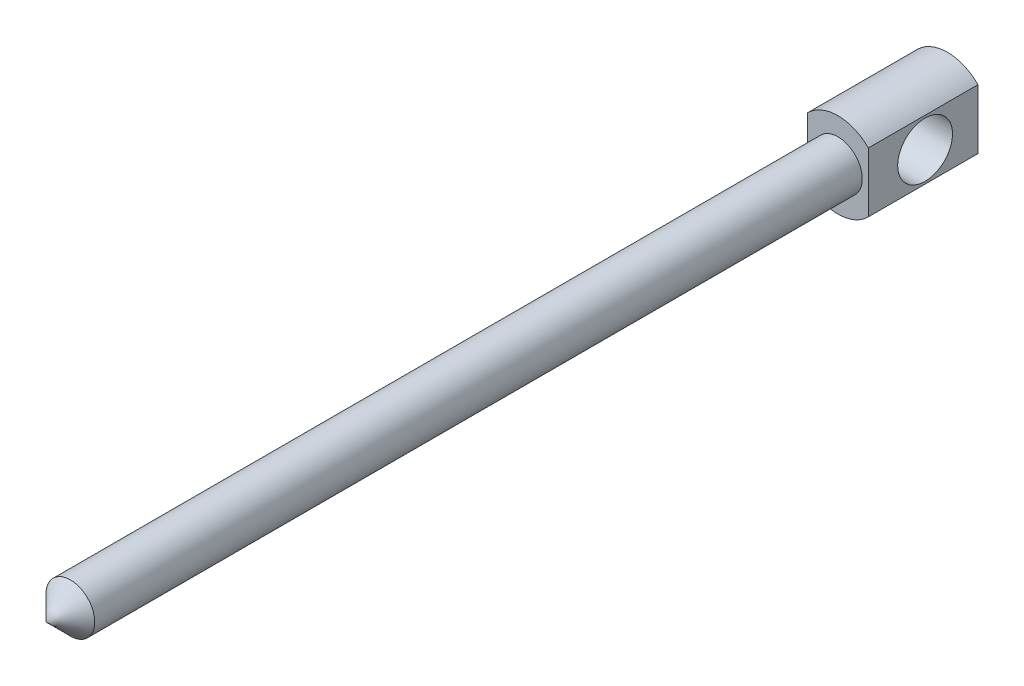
from build123d import *

# Parameters (mm, degrees)
ESQUISSE1_R                  = 2
EXTRUSION1_DEPTH             = 65
CHANFREIN1_SIZE              = 2
ESQUISSE2_R                  = 3.5
EXTRUSION2_DEPTH             = 9
ENL_V_MAT_EXTRU_1_DEPTH      = 66.188189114
ENL_V_MAT_EXTRU_1_DEPTH_BACK = 66.188189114
ESQUISSE3_W                  = 1.863560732
ESQUISSE3_H                  = 10.915141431
ESQUISSE3_W_2                = 2.396006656
ESQUISSE3_H_2                = 11.802551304
ESQUISSE4_R                  = 2.25
ENL_V_MAT_EXTRU_2_DEPTH      = 66.285909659


with BuildPart() as part:
    # Esquisse1 → Extrusion1 (new body)
    with BuildSketch(Plane.XY):
        Circle(ESQUISSE1_R)
    extrude(amount=EXTRUSION1_DEPTH)

    # Chanfrein1
    chanfrein1_edges = [part.edges().sort_by_distance(p)[0] for p in [
        (-2, 0, 65),
    ]]
    chamfer(chanfrein1_edges, length=CHANFREIN1_SIZE)

    # Esquisse2 → Extrusion2 (add)
    with BuildSketch(Plane(origin=(0, 0, 0), x_dir=(-1, 0, 0), z_dir=(0, 0, -1))):
        Circle(ESQUISSE2_R)
    extrude(amount=EXTRUSION2_DEPTH)

    # Esquisse3 → Enl_v. mat.-Extru.1 (cut, two sides: drawn at the far end of the back side and taken through both)
    with BuildSketch(Plane(origin=(0, 0, 0), x_dir=(1, 0, 0), z_dir=(0, 1, 0)).offset(-ENL_V_MAT_EXTRU_1_DEPTH_BACK)):
        with Locations((-3.431780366, 4.263449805)):
            Rectangle(ESQUISSE3_W, ESQUISSE3_H)
        with Locations((3.698003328, 4.707154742)):
            Rectangle(ESQUISSE3_W_2, ESQUISSE3_H_2)
    extrude(amount=ENL_V_MAT_EXTRU_1_DEPTH + ENL_V_MAT_EXTRU_1_DEPTH_BACK, mode=Mode.SUBTRACT)

    # Esquisse4 → Enl_v. mat.-Extru.2 (cut, through all)
    with BuildSketch(Plane.ZY.offset(2.5)):
        with Locations((-4.657368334, 0)):
            Circle(ESQUISSE4_R)
    extrude(amount=-ENL_V_MAT_EXTRU_2_DEPTH, mode=Mode.SUBTRACT)


solid = part.part
